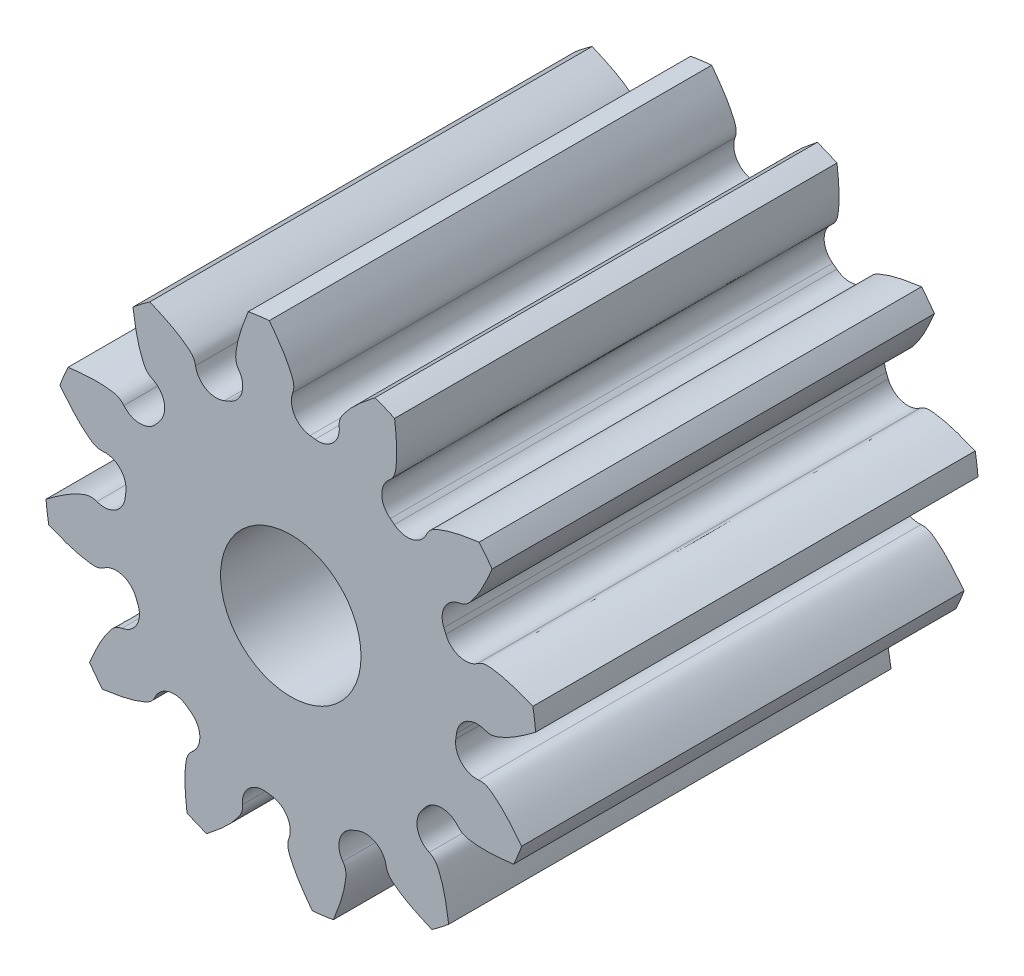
from build123d import *

# Parameters (mm, degrees)
ESQUISSE1_R                        = 2.375
BASE_EXTRUSION_DEPTH               = 6.3
BOSS_EXTRU_1_DEPTH                 = 6.3
CONG_1_R                           = 0.3
R_P_TITION_CIRCULAIRE1_COUNT       = 12
CONG_1_OF_R_P_TITION_CIRCULAIRE1_R = 0.3
ESQUISSE3_R                        = 1
ENL_V_MAT_EXTRU_2_DEPTH            = 9.000154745


with BuildPart() as part:
    # Esquisse1 → Base-Extrusion (new body)
    with BuildSketch(Plane.XY):
        Circle(ESQUISSE1_R)
    extrude(amount=BASE_EXTRUSION_DEPTH)

    # Esquisse2 → Boss.-Extru.1 (add)
    with BuildSketch(Plane.XY):
        with BuildLine():
            Line((2.339110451, 0.411323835), (2.365893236, 0.207784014))
            add(Edge.make_bspline(
                [(2.365893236, 0.207784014), (2.397666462, 0.194705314), (2.56405268, 0.126216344), (2.752522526, -0.095560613), (3.140622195, 0.049124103), (3.334378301, 0.193105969), (3.486579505, 0.306208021)],
                knots=[0, 0, 0, 0, 0.081431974, 0.426433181, 0.549446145, 1, 1, 1, 1], degree=3))
            ThreePointArc((3.486579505, 0.306208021), (3.470087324, 0.456611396), (3.447110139, 0.606161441))
            add(Edge.make_bspline(
                [(2.339110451, 0.411323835), (2.366418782, 0.432176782), (2.509423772, 0.541376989), (2.634106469, 0.804360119), (3.046423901, 0.764998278), (3.270831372, 0.676040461), (3.447110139, 0.606161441)],
                knots=[0, 0, 0, 0, 0.081431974, 0.426433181, 0.549446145, 1, 1, 1, 1], degree=3))
        make_face()
    boss_extru_1 = extrude(amount=BOSS_EXTRU_1_DEPTH)

    # Cong_1
    cong_1_edges = [part.edges().sort_by_distance(p)[0] for p in [
        (2.339110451, 0.411323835, 3.15),
        (2.365893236, 0.207784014, 3.15),
    ]]
    fillet(cong_1_edges, radius=CONG_1_R)

    # R_p_tition circulaire1: Boss.-Extru.1 ×12 about axis
    r_p_tition_circulaire1_axis = Axis((0, 0, -50), (0, 0, 1))
    for i in range(1, R_P_TITION_CIRCULAIRE1_COUNT):
        add(boss_extru_1.rotate(r_p_tition_circulaire1_axis, i * 360 / R_P_TITION_CIRCULAIRE1_COUNT))

    # Cong_1 of R_p_tition circulaire1
    cong_1_of_r_p_tition_circulaire1_edges = [part.edges().sort_by_distance(p)[0] for p in [
        (1.820067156, 1.525772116, 3.15),
        (1.945031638, 1.362892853, 3.15),
        (0.813338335, 2.23139099, 3.15),
        (1.003000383, 2.152815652, 3.15),
        (-0.411323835, 2.339110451, 3.15),
        (-0.207784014, 2.365893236, 3.15),
        (-1.525772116, 1.820067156, 3.15),
        (-1.362892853, 1.945031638, 3.15),
        (-2.23139099, 0.813338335, 3.15),
        (-2.152815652, 1.003000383, 3.15),
        (-2.339110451, -0.411323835, 3.15),
        (-2.365893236, -0.207784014, 3.15),
        (-1.820067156, -1.525772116, 3.15),
        (-1.945031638, -1.362892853, 3.15),
        (-0.813338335, -2.23139099, 3.15),
        (-1.003000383, -2.152815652, 3.15),
        (0.411323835, -2.339110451, 3.15),
        (0.207784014, -2.365893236, 3.15),
        (1.525772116, -1.820067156, 3.15),
        (1.362892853, -1.945031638, 3.15),
        (2.23139099, -0.813338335, 3.15),
        (2.152815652, -1.003000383, 3.15),
    ]]
    fillet(cong_1_of_r_p_tition_circulaire1_edges, radius=CONG_1_OF_R_P_TITION_CIRCULAIRE1_R)

    # Esquisse3 → Enl_v. mat.-Extru.2 (cut, through all)
    with BuildSketch(Plane.XY):
        Circle(ESQUISSE3_R)
    extrude(amount=ENL_V_MAT_EXTRU_2_DEPTH, mode=Mode.SUBTRACT)


solid = part.part
